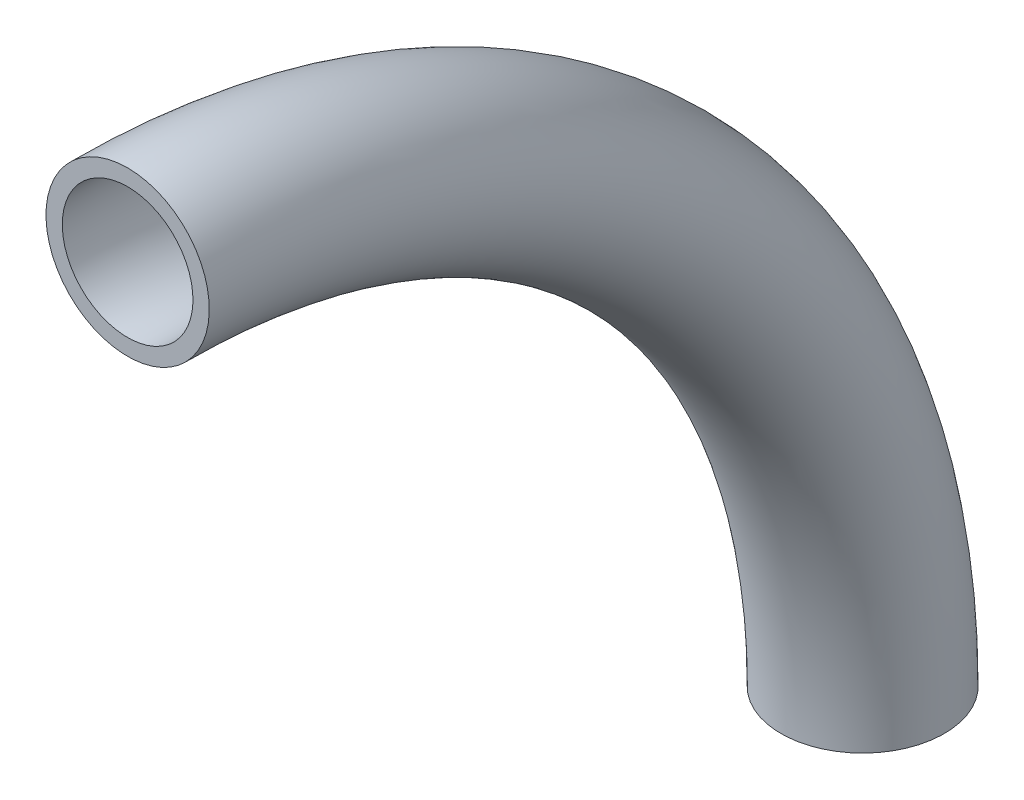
from build123d import *

# Parameters (mm, degrees)
SKIZZE7_R       = 0.5
SKIZZE7_R_2     = 0.4
ROTATION2_ANGLE = 90


with BuildPart() as part:
    # Skizze7 → Rotation2 (revolve)
    with BuildSketch(Plane(origin=(0, 0, 0), x_dir=(1, 0, 0), z_dir=(0, 1, 0))):
        Circle(SKIZZE7_R)
        Circle(SKIZZE7_R_2, mode=Mode.SUBTRACT)
    revolve(axis=Axis((0, 0, 4.5), (1, 0, 0)), revolution_arc=ROTATION2_ANGLE)


solid = part.part
